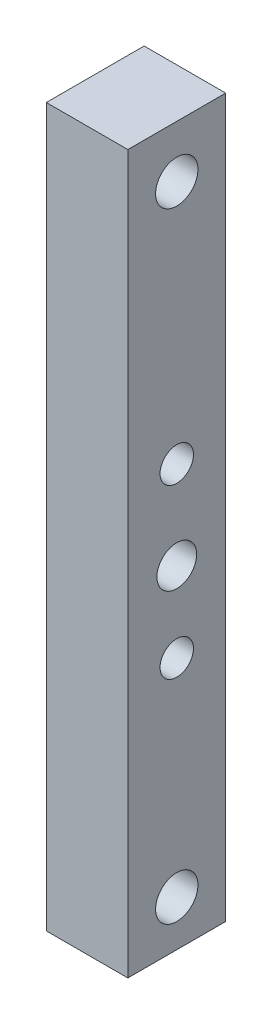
ISO-10303-21;
HEADER;
FILE_DESCRIPTION(('STEP AP214'),'2;1');
FILE_NAME('part.step','',(''),(''),'','','');
FILE_SCHEMA(('AUTOMOTIVE_DESIGN { 1 0 10303 214 1 1 1 1 }'));
ENDSEC;
DATA;
#1=APPLICATION_CONTEXT('core data for automotive mechanical design processes');
#2=APPLICATION_PROTOCOL_DEFINITION('international standard','automotive_design',2000,#1);
#3=PRODUCT_CONTEXT('',#1,'mechanical');
#4=PRODUCT('Part','Part','',(#3));
#5=PRODUCT_RELATED_PRODUCT_CATEGORY('part','',(#4));
#6=PRODUCT_DEFINITION_FORMATION('','',#4);
#7=PRODUCT_DEFINITION_CONTEXT('part definition',#1,'design');
#8=PRODUCT_DEFINITION('design','',#6,#7);
#9=PRODUCT_DEFINITION_SHAPE('','',#8);
#10=(LENGTH_UNIT() NAMED_UNIT(*) SI_UNIT(.MILLI.,.METRE.));
#11=(NAMED_UNIT(*) PLANE_ANGLE_UNIT() SI_UNIT($,.RADIAN.));
#12=(NAMED_UNIT(*) SI_UNIT($,.STERADIAN.) SOLID_ANGLE_UNIT());
#13=UNCERTAINTY_MEASURE_WITH_UNIT(LENGTH_MEASURE(1.E-05),#10,'distance_accuracy_value','');
#14=(GEOMETRIC_REPRESENTATION_CONTEXT(3) GLOBAL_UNCERTAINTY_ASSIGNED_CONTEXT((#13)) GLOBAL_UNIT_ASSIGNED_CONTEXT((#10,
#11,#12)) REPRESENTATION_CONTEXT('',''));
#15=CARTESIAN_POINT('',(0.,0.,0.));
#16=DIRECTION('',(0.,0.,1.));
#17=DIRECTION('',(1.,0.,0.));
#18=AXIS2_PLACEMENT_3D('',#15,#16,#17);
#19=CARTESIAN_POINT('',(-123.,-158.,80.));
#20=DIRECTION('',(0.,0.,1.));
#21=DIRECTION('',(0.,1.,0.));
#22=AXIS2_PLACEMENT_3D('',#19,#20,#21);
#23=PLANE('',#22);
#24=DIRECTION('',(0.,-1.,0.));
#25=VECTOR('',#24,1.);
#26=CARTESIAN_POINT('',(-148.,-48.,80.));
#27=LINE('',#26,#25);
#28=CARTESIAN_POINT('',(-148.,62.,80.));
#29=VERTEX_POINT('',#28);
#30=CARTESIAN_POINT('',(-148.,-158.,80.));
#31=VERTEX_POINT('',#30);
#32=EDGE_CURVE('E101',#29,#31,#27,.T.);
#33=ORIENTED_EDGE('',*,*,#32,.T.);
#34=DIRECTION('',(-1.,0.,0.));
#35=VECTOR('',#34,1.);
#36=CARTESIAN_POINT('',(-135.5,-158.,80.));
#37=LINE('',#36,#35);
#38=CARTESIAN_POINT('',(-123.,-158.,80.));
#39=VERTEX_POINT('',#38);
#40=EDGE_CURVE('E73',#39,#31,#37,.T.);
#41=ORIENTED_EDGE('',*,*,#40,.F.);
#42=DIRECTION('',(0.,-1.,0.));
#43=VECTOR('',#42,1.);
#44=CARTESIAN_POINT('',(-123.,-48.,80.));
#45=LINE('',#44,#43);
#46=CARTESIAN_POINT('',(-123.,62.,80.));
#47=VERTEX_POINT('',#46);
#48=EDGE_CURVE('E69',#47,#39,#45,.T.);
#49=ORIENTED_EDGE('',*,*,#48,.F.);
#50=DIRECTION('',(1.,0.,0.));
#51=VECTOR('',#50,1.);
#52=CARTESIAN_POINT('',(-135.5,62.,80.));
#53=LINE('',#52,#51);
#54=EDGE_CURVE('E58',#29,#47,#53,.T.);
#55=ORIENTED_EDGE('',*,*,#54,.F.);
#56=EDGE_LOOP('',(#33,#41,#49,#55));
#57=FACE_BOUND('',#56,.T.);
#58=ADVANCED_FACE('F16',(#57),#23,.T.);
#59=CARTESIAN_POINT('',(-123.,-158.,50.));
#60=DIRECTION('',(0.,-1.,0.));
#61=DIRECTION('',(0.,0.,1.));
#62=AXIS2_PLACEMENT_3D('',#59,#60,#61);
#63=PLANE('',#62);
#64=DIRECTION('',(0.,0.,-1.));
#65=VECTOR('',#64,1.);
#66=CARTESIAN_POINT('',(-148.,-158.,65.));
#67=LINE('',#66,#65);
#68=CARTESIAN_POINT('',(-148.,-158.,50.));
#69=VERTEX_POINT('',#68);
#70=EDGE_CURVE('E113',#31,#69,#67,.T.);
#71=ORIENTED_EDGE('',*,*,#70,.T.);
#72=DIRECTION('',(-1.,0.,0.));
#73=VECTOR('',#72,1.);
#74=CARTESIAN_POINT('',(-135.5,-158.,50.));
#75=LINE('',#74,#73);
#76=CARTESIAN_POINT('',(-123.,-158.,50.));
#77=VERTEX_POINT('',#76);
#78=EDGE_CURVE('E81',#77,#69,#75,.T.);
#79=ORIENTED_EDGE('',*,*,#78,.F.);
#80=DIRECTION('',(0.,0.,-1.));
#81=VECTOR('',#80,1.);
#82=CARTESIAN_POINT('',(-123.,-158.,65.));
#83=LINE('',#82,#81);
#84=EDGE_CURVE('E75',#39,#77,#83,.T.);
#85=ORIENTED_EDGE('',*,*,#84,.F.);
#86=ORIENTED_EDGE('',*,*,#40,.T.);
#87=EDGE_LOOP('',(#71,#79,#85,#86));
#88=FACE_BOUND('',#87,.T.);
#89=ADVANCED_FACE('F124',(#88),#63,.T.);
#90=CARTESIAN_POINT('',(-123.,62.,50.));
#91=DIRECTION('',(0.,0.,-1.));
#92=DIRECTION('',(0.,-1.,0.));
#93=AXIS2_PLACEMENT_3D('',#90,#91,#92);
#94=PLANE('',#93);
#95=DIRECTION('',(0.,1.,0.));
#96=VECTOR('',#95,1.);
#97=CARTESIAN_POINT('',(-148.,-48.,50.));
#98=LINE('',#97,#96);
#99=CARTESIAN_POINT('',(-148.,62.,50.));
#100=VERTEX_POINT('',#99);
#101=EDGE_CURVE('E116',#69,#100,#98,.T.);
#102=ORIENTED_EDGE('',*,*,#101,.T.);
#103=DIRECTION('',(-1.,0.,0.));
#104=VECTOR('',#103,1.);
#105=CARTESIAN_POINT('',(-135.5,62.,50.));
#106=LINE('',#105,#104);
#107=CARTESIAN_POINT('',(-123.,62.,50.));
#108=VERTEX_POINT('',#107);
#109=EDGE_CURVE('E35',#108,#100,#106,.T.);
#110=ORIENTED_EDGE('',*,*,#109,.F.);
#111=DIRECTION('',(0.,1.,0.));
#112=VECTOR('',#111,1.);
#113=CARTESIAN_POINT('',(-123.,-48.,50.));
#114=LINE('',#113,#112);
#115=EDGE_CURVE('E71',#77,#108,#114,.T.);
#116=ORIENTED_EDGE('',*,*,#115,.F.);
#117=ORIENTED_EDGE('',*,*,#78,.T.);
#118=EDGE_LOOP('',(#102,#110,#116,#117));
#119=FACE_BOUND('',#118,.T.);
#120=ADVANCED_FACE('F119',(#119),#94,.T.);
#121=CARTESIAN_POINT('',(-123.,62.,80.));
#122=DIRECTION('',(0.,1.,0.));
#123=DIRECTION('',(0.,0.,-1.));
#124=AXIS2_PLACEMENT_3D('',#121,#122,#123);
#125=PLANE('',#124);
#126=DIRECTION('',(0.,0.,1.));
#127=VECTOR('',#126,1.);
#128=CARTESIAN_POINT('',(-148.,62.,65.));
#129=LINE('',#128,#127);
#130=EDGE_CURVE('E62',#100,#29,#129,.T.);
#131=ORIENTED_EDGE('',*,*,#130,.T.);
#132=ORIENTED_EDGE('',*,*,#54,.T.);
#133=DIRECTION('',(0.,0.,1.));
#134=VECTOR('',#133,1.);
#135=CARTESIAN_POINT('',(-123.,62.,65.));
#136=LINE('',#135,#134);
#137=EDGE_CURVE('E61',#108,#47,#136,.T.);
#138=ORIENTED_EDGE('',*,*,#137,.F.);
#139=ORIENTED_EDGE('',*,*,#109,.T.);
#140=EDGE_LOOP('',(#131,#132,#138,#139));
#141=FACE_BOUND('',#140,.T.);
#142=ADVANCED_FACE('F60',(#141),#125,.T.);
#143=CARTESIAN_POINT('',(-123.,-144.,65.));
#144=DIRECTION('',(-1.,0.,0.));
#145=DIRECTION('',(0.,-1.,0.));
#146=AXIS2_PLACEMENT_3D('',#143,#144,#145);
#147=CYLINDRICAL_SURFACE('',#146,6.50000000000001);
#148=CARTESIAN_POINT('',(-148.,-144.,65.));
#149=DIRECTION('',(-1.,0.,0.));
#150=DIRECTION('',(0.,-1.,0.));
#151=AXIS2_PLACEMENT_3D('',#148,#149,#150);
#152=CIRCLE('',#151,6.50000000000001);
#153=CARTESIAN_POINT('',(-148.,-150.5,65.));
#154=VERTEX_POINT('',#153);
#155=EDGE_CURVE('E95',#154,#154,#152,.T.);
#156=ORIENTED_EDGE('',*,*,#155,.T.);
#157=EDGE_LOOP('',(#156));
#158=FACE_BOUND('',#157,.T.);
#159=CARTESIAN_POINT('',(-123.,-144.,65.));
#160=DIRECTION('',(-1.,0.,0.));
#161=DIRECTION('',(0.,-1.,0.));
#162=AXIS2_PLACEMENT_3D('',#159,#160,#161);
#163=CIRCLE('',#162,6.50000000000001);
#164=CARTESIAN_POINT('',(-123.,-150.5,65.));
#165=VERTEX_POINT('',#164);
#166=EDGE_CURVE('E20',#165,#165,#163,.T.);
#167=ORIENTED_EDGE('',*,*,#166,.F.);
#168=EDGE_LOOP('',(#167));
#169=FACE_BOUND('',#168,.T.);
#170=ADVANCED_FACE('F155',(#158,#169),#147,.F.);
#171=CARTESIAN_POINT('',(-123.,46.,65.));
#172=DIRECTION('',(-1.,0.,0.));
#173=DIRECTION('',(0.,-1.,0.));
#174=AXIS2_PLACEMENT_3D('',#171,#172,#173);
#175=CYLINDRICAL_SURFACE('',#174,6.50000000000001);
#176=CARTESIAN_POINT('',(-148.,46.,65.));
#177=DIRECTION('',(-1.,0.,0.));
#178=DIRECTION('',(0.,-1.,0.));
#179=AXIS2_PLACEMENT_3D('',#176,#177,#178);
#180=CIRCLE('',#179,6.50000000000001);
#181=CARTESIAN_POINT('',(-148.,39.5,65.));
#182=VERTEX_POINT('',#181);
#183=EDGE_CURVE('E92',#182,#182,#180,.T.);
#184=ORIENTED_EDGE('',*,*,#183,.T.);
#185=EDGE_LOOP('',(#184));
#186=FACE_BOUND('',#185,.T.);
#187=CARTESIAN_POINT('',(-123.,46.,65.));
#188=DIRECTION('',(-1.,0.,0.));
#189=DIRECTION('',(0.,-1.,0.));
#190=AXIS2_PLACEMENT_3D('',#187,#188,#189);
#191=CIRCLE('',#190,6.50000000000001);
#192=CARTESIAN_POINT('',(-123.,39.5,65.));
#193=VERTEX_POINT('',#192);
#194=EDGE_CURVE('E104',#193,#193,#191,.T.);
#195=ORIENTED_EDGE('',*,*,#194,.F.);
#196=EDGE_LOOP('',(#195));
#197=FACE_BOUND('',#196,.T.);
#198=ADVANCED_FACE('F151',(#186,#197),#175,.F.);
#199=CARTESIAN_POINT('',(-123.,-29.,65.));
#200=DIRECTION('',(-1.,0.,0.));
#201=DIRECTION('',(0.,-1.,0.));
#202=AXIS2_PLACEMENT_3D('',#199,#200,#201);
#203=CYLINDRICAL_SURFACE('',#202,5.12499999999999);
#204=CARTESIAN_POINT('',(-148.,-29.,65.));
#205=DIRECTION('',(-1.,0.,0.));
#206=DIRECTION('',(0.,-1.,0.));
#207=AXIS2_PLACEMENT_3D('',#204,#205,#206);
#208=CIRCLE('',#207,5.12499999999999);
#209=CARTESIAN_POINT('',(-148.,-34.125,65.));
#210=VERTEX_POINT('',#209);
#211=EDGE_CURVE('E89',#210,#210,#208,.T.);
#212=ORIENTED_EDGE('',*,*,#211,.T.);
#213=EDGE_LOOP('',(#212));
#214=FACE_BOUND('',#213,.T.);
#215=CARTESIAN_POINT('',(-123.,-29.,65.));
#216=DIRECTION('',(-1.,0.,0.));
#217=DIRECTION('',(0.,-1.,0.));
#218=AXIS2_PLACEMENT_3D('',#215,#216,#217);
#219=CIRCLE('',#218,5.12499999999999);
#220=CARTESIAN_POINT('',(-123.,-34.125,65.));
#221=VERTEX_POINT('',#220);
#222=EDGE_CURVE('E102',#221,#221,#219,.T.);
#223=ORIENTED_EDGE('',*,*,#222,.F.);
#224=EDGE_LOOP('',(#223));
#225=FACE_BOUND('',#224,.T.);
#226=ADVANCED_FACE('F147',(#214,#225),#203,.F.);
#227=CARTESIAN_POINT('',(-123.,-80.5,65.));
#228=DIRECTION('',(-1.,0.,0.));
#229=DIRECTION('',(0.,-1.,0.));
#230=AXIS2_PLACEMENT_3D('',#227,#228,#229);
#231=CYLINDRICAL_SURFACE('',#230,5.12499999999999);
#232=CARTESIAN_POINT('',(-148.,-80.5,65.));
#233=DIRECTION('',(-1.,0.,0.));
#234=DIRECTION('',(0.,-1.,0.));
#235=AXIS2_PLACEMENT_3D('',#232,#233,#234);
#236=CIRCLE('',#235,5.12499999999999);
#237=CARTESIAN_POINT('',(-148.,-85.625,65.));
#238=VERTEX_POINT('',#237);
#239=EDGE_CURVE('E86',#238,#238,#236,.T.);
#240=ORIENTED_EDGE('',*,*,#239,.T.);
#241=EDGE_LOOP('',(#240));
#242=FACE_BOUND('',#241,.T.);
#243=CARTESIAN_POINT('',(-123.,-80.5,65.));
#244=DIRECTION('',(-1.,0.,0.));
#245=DIRECTION('',(0.,-1.,0.));
#246=AXIS2_PLACEMENT_3D('',#243,#244,#245);
#247=CIRCLE('',#246,5.12499999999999);
#248=CARTESIAN_POINT('',(-123.,-85.625,65.));
#249=VERTEX_POINT('',#248);
#250=EDGE_CURVE('E98',#249,#249,#247,.T.);
#251=ORIENTED_EDGE('',*,*,#250,.F.);
#252=EDGE_LOOP('',(#251));
#253=FACE_BOUND('',#252,.T.);
#254=ADVANCED_FACE('F144',(#242,#253),#231,.F.);
#255=CARTESIAN_POINT('',(-123.,62.,50.));
#256=DIRECTION('',(1.,0.,0.));
#257=DIRECTION('',(0.,0.,1.));
#258=AXIS2_PLACEMENT_3D('',#255,#256,#257);
#259=PLANE('',#258);
#260=ORIENTED_EDGE('',*,*,#250,.T.);
#261=EDGE_LOOP('',(#260));
#262=FACE_BOUND('',#261,.T.);
#263=ORIENTED_EDGE('',*,*,#222,.T.);
#264=EDGE_LOOP('',(#263));
#265=FACE_BOUND('',#264,.T.);
#266=ORIENTED_EDGE('',*,*,#194,.T.);
#267=EDGE_LOOP('',(#266));
#268=FACE_BOUND('',#267,.T.);
#269=ORIENTED_EDGE('',*,*,#166,.T.);
#270=EDGE_LOOP('',(#269));
#271=FACE_BOUND('',#270,.T.);
#272=CARTESIAN_POINT('',(-123.,-56.,65.));
#273=DIRECTION('',(-1.,0.,0.));
#274=DIRECTION('',(0.,-1.,0.));
#275=AXIS2_PLACEMENT_3D('',#272,#273,#274);
#276=CIRCLE('',#275,6.09999999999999);
#277=CARTESIAN_POINT('',(-123.,-62.1,65.));
#278=VERTEX_POINT('',#277);
#279=EDGE_CURVE('E26',#278,#278,#276,.F.);
#280=ORIENTED_EDGE('',*,*,#279,.F.);
#281=EDGE_LOOP('',(#280));
#282=FACE_BOUND('',#281,.T.);
#283=ORIENTED_EDGE('',*,*,#84,.T.);
#284=ORIENTED_EDGE('',*,*,#115,.T.);
#285=ORIENTED_EDGE('',*,*,#137,.T.);
#286=ORIENTED_EDGE('',*,*,#48,.T.);
#287=EDGE_LOOP('',(#283,#284,#285,#286));
#288=FACE_BOUND('',#287,.T.);
#289=ADVANCED_FACE('F68',(#262,#265,#268,#271,#282,#288),#259,.T.);
#290=CARTESIAN_POINT('',(-148.,62.,50.));
#291=DIRECTION('',(1.,0.,0.));
#292=DIRECTION('',(0.,0.,1.));
#293=AXIS2_PLACEMENT_3D('',#290,#291,#292);
#294=PLANE('',#293);
#295=ORIENTED_EDGE('',*,*,#239,.F.);
#296=EDGE_LOOP('',(#295));
#297=FACE_BOUND('',#296,.T.);
#298=ORIENTED_EDGE('',*,*,#211,.F.);
#299=EDGE_LOOP('',(#298));
#300=FACE_BOUND('',#299,.T.);
#301=ORIENTED_EDGE('',*,*,#183,.F.);
#302=EDGE_LOOP('',(#301));
#303=FACE_BOUND('',#302,.T.);
#304=ORIENTED_EDGE('',*,*,#155,.F.);
#305=EDGE_LOOP('',(#304));
#306=FACE_BOUND('',#305,.T.);
#307=CARTESIAN_POINT('',(-148.,-56.,65.));
#308=DIRECTION('',(-1.,0.,0.));
#309=DIRECTION('',(0.,-1.,0.));
#310=AXIS2_PLACEMENT_3D('',#307,#308,#309);
#311=CIRCLE('',#310,6.09999999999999);
#312=CARTESIAN_POINT('',(-148.,-62.1,65.));
#313=VERTEX_POINT('',#312);
#314=EDGE_CURVE('E11',#313,#313,#311,.T.);
#315=ORIENTED_EDGE('',*,*,#314,.F.);
#316=EDGE_LOOP('',(#315));
#317=FACE_BOUND('',#316,.T.);
#318=ORIENTED_EDGE('',*,*,#101,.F.);
#319=ORIENTED_EDGE('',*,*,#70,.F.);
#320=ORIENTED_EDGE('',*,*,#32,.F.);
#321=ORIENTED_EDGE('',*,*,#130,.F.);
#322=EDGE_LOOP('',(#318,#319,#320,#321));
#323=FACE_BOUND('',#322,.T.);
#324=ADVANCED_FACE('F18',(#297,#300,#303,#306,#317,#323),#294,.F.);
#325=CARTESIAN_POINT('',(-123.,-56.,65.));
#326=DIRECTION('',(-1.,0.,0.));
#327=DIRECTION('',(0.,-1.,0.));
#328=AXIS2_PLACEMENT_3D('',#325,#326,#327);
#329=CYLINDRICAL_SURFACE('',#328,6.09999999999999);
#330=ORIENTED_EDGE('',*,*,#314,.T.);
#331=EDGE_LOOP('',(#330));
#332=FACE_BOUND('',#331,.T.);
#333=ORIENTED_EDGE('',*,*,#279,.T.);
#334=EDGE_LOOP('',(#333));
#335=FACE_BOUND('',#334,.T.);
#336=ADVANCED_FACE('F134',(#332,#335),#329,.F.);
#337=CLOSED_SHELL('',(#58,#89,#120,#142,#170,#198,#226,#254,#289,#324,#336));
#338=MANIFOLD_SOLID_BREP('B1',#337);
#339=ADVANCED_BREP_SHAPE_REPRESENTATION('',(#18,#338),#14);
#340=SHAPE_DEFINITION_REPRESENTATION(#9,#339);
ENDSEC;
END-ISO-10303-21;
